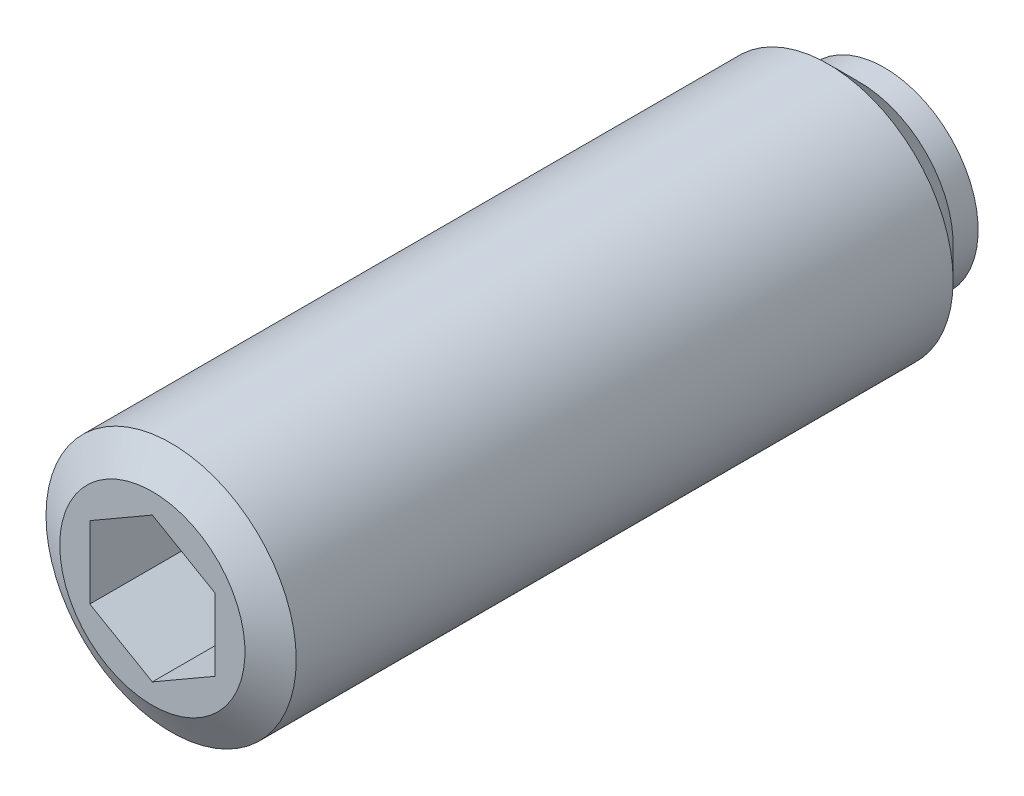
ISO-10303-21;
HEADER;
FILE_DESCRIPTION(('STEP AP214'),'2;1');
FILE_NAME('part.step','',(''),(''),'','','');
FILE_SCHEMA(('AUTOMOTIVE_DESIGN { 1 0 10303 214 1 1 1 1 }'));
ENDSEC;
DATA;
#1=APPLICATION_CONTEXT('core data for automotive mechanical design processes');
#2=APPLICATION_PROTOCOL_DEFINITION('international standard','automotive_design',2000,#1);
#3=PRODUCT_CONTEXT('',#1,'mechanical');
#4=PRODUCT('Part','Part','',(#3));
#5=PRODUCT_RELATED_PRODUCT_CATEGORY('part','',(#4));
#6=PRODUCT_DEFINITION_FORMATION('','',#4);
#7=PRODUCT_DEFINITION_CONTEXT('part definition',#1,'design');
#8=PRODUCT_DEFINITION('design','',#6,#7);
#9=PRODUCT_DEFINITION_SHAPE('','',#8);
#10=(LENGTH_UNIT() NAMED_UNIT(*) SI_UNIT(.MILLI.,.METRE.));
#11=(NAMED_UNIT(*) PLANE_ANGLE_UNIT() SI_UNIT($,.RADIAN.));
#12=(NAMED_UNIT(*) SI_UNIT($,.STERADIAN.) SOLID_ANGLE_UNIT());
#13=UNCERTAINTY_MEASURE_WITH_UNIT(LENGTH_MEASURE(1.E-05),#10,'distance_accuracy_value','');
#14=(GEOMETRIC_REPRESENTATION_CONTEXT(3) GLOBAL_UNCERTAINTY_ASSIGNED_CONTEXT((#13)) GLOBAL_UNIT_ASSIGNED_CONTEXT((#10,
#11,#12)) REPRESENTATION_CONTEXT('',''));
#15=CARTESIAN_POINT('',(0.,0.,0.));
#16=DIRECTION('',(0.,0.,1.));
#17=DIRECTION('',(1.,0.,0.));
#18=AXIS2_PLACEMENT_3D('',#15,#16,#17);
#19=CARTESIAN_POINT('',(0.,0.940733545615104,0.));
#20=DIRECTION('',(0.,0.,1.));
#21=DIRECTION('',(-1.,0.,0.));
#22=AXIS2_PLACEMENT_3D('',#19,#20,#21);
#23=PLANE('',#22);
#24=CARTESIAN_POINT('',(0.,0.,0.));
#25=DIRECTION('',(0.,0.,1.));
#26=DIRECTION('',(-1.,0.,0.));
#27=AXIS2_PLACEMENT_3D('',#24,#25,#26);
#28=CIRCLE('',#27,0.940733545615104);
#29=CARTESIAN_POINT('',(0.,0.9407335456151,0.));
#30=VERTEX_POINT('',#29);
#31=EDGE_CURVE('E9',#30,#30,#28,.T.);
#32=ORIENTED_EDGE('',*,*,#31,.F.);
#33=EDGE_LOOP('',(#32));
#34=FACE_BOUND('',#33,.T.);
#35=ADVANCED_FACE('F14',(#34),#23,.F.);
#36=CARTESIAN_POINT('',(0.,0.,0.823116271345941));
#37=DIRECTION('',(0.,0.,1.));
#38=DIRECTION('',(0.,1.,0.));
#39=AXIS2_PLACEMENT_3D('',#36,#37,#38);
#40=SPHERICAL_SURFACE('',#39,1.25);
#41=CARTESIAN_POINT('',(0.,0.,0.2));
#42=DIRECTION('',(0.,0.,1.));
#43=DIRECTION('',(-1.,0.,0.));
#44=AXIS2_PLACEMENT_3D('',#41,#42,#43);
#45=CIRCLE('',#44,1.0836171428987);
#46=CARTESIAN_POINT('',(0.,1.0836171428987,0.2));
#47=VERTEX_POINT('',#46);
#48=EDGE_CURVE('E21',#47,#47,#45,.T.);
#49=CARTESIAN_POINT('',(0.,1.0836171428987,0.2));
#50=CARTESIAN_POINT('',(0.,1.08233874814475,0.197776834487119));
#51=CARTESIAN_POINT('',(0.,1.08105351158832,0.1955576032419));
#52=CARTESIAN_POINT('',(0.,1.0784694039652,0.191127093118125));
#53=CARTESIAN_POINT('',(0.,1.0771705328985,0.188915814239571));
#54=CARTESIAN_POINT('',(0.,1.07455920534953,0.184501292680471));
#55=CARTESIAN_POINT('',(0.,1.07324674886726,0.182298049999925));
#56=CARTESIAN_POINT('',(0.,1.07060830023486,0.177899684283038));
#57=CARTESIAN_POINT('',(0.,1.06928230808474,0.175704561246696));
#58=CARTESIAN_POINT('',(0.,1.06661683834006,0.171322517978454));
#59=CARTESIAN_POINT('',(0.,1.0652773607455,0.169135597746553));
#60=CARTESIAN_POINT('',(0.,1.06258497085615,0.164770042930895));
#61=CARTESIAN_POINT('',(0.,1.06123205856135,0.162591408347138));
#62=CARTESIAN_POINT('',(0.,1.05851285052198,0.158242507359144));
#63=CARTESIAN_POINT('',(0.,1.05714655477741,0.156072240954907));
#64=CARTESIAN_POINT('',(0.,1.05440063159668,0.151740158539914));
#65=CARTESIAN_POINT('',(0.,1.05302100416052,0.149578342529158));
#66=CARTESIAN_POINT('',(0.,1.05024846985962,0.145263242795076));
#67=CARTESIAN_POINT('',(0.,1.04885556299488,0.143109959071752));
#68=CARTESIAN_POINT('',(0.,1.04605652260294,0.138812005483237));
#69=CARTESIAN_POINT('',(0.,1.04465038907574,0.136667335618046));
#70=CARTESIAN_POINT('',(0.,1.04182494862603,0.132386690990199));
#71=CARTESIAN_POINT('',(0.,1.04040564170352,0.130250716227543));
#72=CARTESIAN_POINT('',(0.,1.0375539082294,0.125987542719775));
#73=CARTESIAN_POINT('',(0.,1.03612148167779,0.123860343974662));
#74=CARTESIAN_POINT('',(0.,1.03324356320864,0.119614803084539));
#75=CARTESIAN_POINT('',(0.,1.03179807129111,0.117496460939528));
#76=CARTESIAN_POINT('',(0.,1.02889407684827,0.113268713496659));
#77=CARTESIAN_POINT('',(0.,1.02743557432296,0.1111593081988));
#78=CARTESIAN_POINT('',(0.,1.02450561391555,0.106949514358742));
#79=CARTESIAN_POINT('',(0.,1.02303415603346,0.104849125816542));
#80=CARTESIAN_POINT('',(0.,1.02007834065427,0.100657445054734));
#81=CARTESIAN_POINT('',(0.,1.01859398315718,0.0985661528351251));
#82=CARTESIAN_POINT('',(0.,1.01561242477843,0.094392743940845));
#83=CARTESIAN_POINT('',(0.,1.01411522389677,0.0923106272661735));
#84=CARTESIAN_POINT('',(0.,1.01110803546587,0.0881556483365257));
#85=CARTESIAN_POINT('',(0.,1.00959804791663,0.0860827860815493));
#86=CARTESIAN_POINT('',(0.,1.00656534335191,0.0819463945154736));
#87=CARTESIAN_POINT('',(0.,1.00504262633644,0.0798828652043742));
#88=CARTESIAN_POINT('',(0.,1.00198452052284,0.0757652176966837));
#89=CARTESIAN_POINT('',(0.,1.00044913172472,0.0737110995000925));
#90=CARTESIAN_POINT('',(0.,0.997365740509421,0.0696123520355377));
#91=CARTESIAN_POINT('',(0.,0.995817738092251,0.0675677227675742));
#92=CARTESIAN_POINT('',(0.,0.992709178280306,0.0634880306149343));
#93=CARTESIAN_POINT('',(0.,0.99114862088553,0.061452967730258));
#94=CARTESIAN_POINT('',(0.,0.988015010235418,0.0573924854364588));
#95=CARTESIAN_POINT('',(0.,0.986441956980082,0.055367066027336));
#96=CARTESIAN_POINT('',(0.,0.983283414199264,0.0513259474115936));
#97=CARTESIAN_POINT('',(0.,0.981697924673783,0.049310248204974));
#98=CARTESIAN_POINT('',(0.,0.978514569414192,0.0452886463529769));
#99=CARTESIAN_POINT('',(0.,0.976916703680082,0.0432827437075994));
#100=CARTESIAN_POINT('',(0.,0.973708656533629,0.0392808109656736));
#101=CARTESIAN_POINT('',(0.,0.972098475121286,0.0372847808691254));
#102=CARTESIAN_POINT('',(0.,0.968865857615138,0.0333026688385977));
#103=CARTESIAN_POINT('',(0.,0.967243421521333,0.0313165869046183));
#104=CARTESIAN_POINT('',(0.,0.963986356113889,0.0273544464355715));
#105=CARTESIAN_POINT('',(0.,0.962351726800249,0.0253783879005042));
#106=CARTESIAN_POINT('',(0.,0.959070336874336,0.0214363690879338));
#107=CARTESIAN_POINT('',(0.,0.957423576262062,0.0194704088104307));
#108=CARTESIAN_POINT('',(0.,0.95411798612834,0.0155486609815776));
#109=CARTESIAN_POINT('',(0.,0.952459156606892,0.0135928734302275));
#110=CARTESIAN_POINT('',(0.,0.949129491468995,0.00969154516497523));
#111=CARTESIAN_POINT('',(0.,0.947458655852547,0.00774600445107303));
#112=CARTESIAN_POINT('',(0.,0.944105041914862,0.00386524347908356));
#113=CARTESIAN_POINT('',(0.,0.942422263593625,0.00193002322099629));
#114=CARTESIAN_POINT('',(0.,0.9407335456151,0.));
#115=B_SPLINE_CURVE_WITH_KNOTS('',3,(#49,#50,#51,#52,#53,#54,#55,#56,#57,#58,#59,#60,#61,#62,
#63,#64,#65,#66,#67,#68,#69,#70,#71,#72,#73,#74,#75,#76,#77,#78,#79,#80,#81,#82,#83,#84,#85,#86,
#87,#88,#89,#90,#91,#92,#93,#94,#95,#96,#97,#98,#99,#100,#101,#102,#103,#104,#105,#106,#107,
#108,#109,#110,#111,#112,#113,#114),.UNSPECIFIED.,.F.,.F.,(4,2,2,2,2,2,2,2,2,2,2,2,2,2,2,2,2,2,
2,2,2,2,2,2,2,2,2,2,2,2,2,2,4),(0.,0.00769354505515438,0.0153870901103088,0.0230806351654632,
0.0307741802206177,0.0384677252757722,0.0461612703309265,0.0538548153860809,0.0615483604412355,
0.0692419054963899,0.0769354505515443,0.0846289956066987,0.092322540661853,0.100016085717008,
0.107709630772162,0.115403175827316,0.123096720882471,0.130790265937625,0.13848381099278,
0.146177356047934,0.153870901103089,0.161564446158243,0.169257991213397,0.176951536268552,
0.184645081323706,0.192338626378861,0.200032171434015,0.20772571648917,0.215419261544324,
0.223112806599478,0.230806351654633,0.238499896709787,0.246193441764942),.UNSPECIFIED.);
#116=EDGE_CURVE('BSEAM141',#47,#30,#115,.T.);
#117=ORIENTED_EDGE('',*,*,#48,.F.);
#118=ORIENTED_EDGE('',*,*,#31,.T.);
#119=ORIENTED_EDGE('',*,*,#116,.T.);
#120=ORIENTED_EDGE('',*,*,#116,.F.);
#121=EDGE_LOOP('',(#117,#119,#118,#120));
#122=FACE_BOUND('',#121,.T.);
#123=ADVANCED_FACE('F141',(#122),#40,.T.);
#124=CARTESIAN_POINT('',(0.,1.5,0.2));
#125=DIRECTION('',(0.,0.,1.));
#126=DIRECTION('',(-1.,0.,0.));
#127=AXIS2_PLACEMENT_3D('',#124,#125,#126);
#128=PLANE('',#127);
#129=CARTESIAN_POINT('',(0.,0.,0.2));
#130=DIRECTION('',(0.,0.,1.));
#131=DIRECTION('',(-1.,0.,0.));
#132=AXIS2_PLACEMENT_3D('',#129,#130,#131);
#133=CIRCLE('',#132,1.5);
#134=CARTESIAN_POINT('',(-1.5,0.,0.2));
#135=VERTEX_POINT('',#134);
#136=EDGE_CURVE('E134',#135,#135,#133,.T.);
#137=ORIENTED_EDGE('',*,*,#136,.F.);
#138=EDGE_LOOP('',(#137));
#139=FACE_BOUND('',#138,.T.);
#140=ORIENTED_EDGE('',*,*,#48,.T.);
#141=EDGE_LOOP('',(#140));
#142=FACE_BOUND('',#141,.T.);
#143=ADVANCED_FACE('F139',(#139,#142),#128,.F.);
#144=CARTESIAN_POINT('',(0.,0.,13.2950749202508));
#145=DIRECTION('',(0.,0.,1.));
#146=DIRECTION('',(-1.,0.,0.));
#147=AXIS2_PLACEMENT_3D('',#144,#145,#146);
#148=CYLINDRICAL_SURFACE('',#147,1.5);
#149=CARTESIAN_POINT('',(0.,0.,0.6));
#150=DIRECTION('',(0.,0.,1.));
#151=DIRECTION('',(-1.,0.,0.));
#152=AXIS2_PLACEMENT_3D('',#149,#150,#151);
#153=CIRCLE('',#152,1.5);
#154=CARTESIAN_POINT('',(-1.5,0.,0.6));
#155=VERTEX_POINT('',#154);
#156=EDGE_CURVE('E131',#155,#155,#153,.T.);
#157=ORIENTED_EDGE('',*,*,#156,.F.);
#158=EDGE_LOOP('',(#157));
#159=FACE_BOUND('',#158,.T.);
#160=ORIENTED_EDGE('',*,*,#136,.T.);
#161=EDGE_LOOP('',(#160));
#162=FACE_BOUND('',#161,.T.);
#163=ADVANCED_FACE('F164',(#159,#162),#148,.T.);
#164=CARTESIAN_POINT('',(0.,0.,0.6));
#165=DIRECTION('',(0.,0.,1.));
#166=DIRECTION('',(-1.,0.,0.));
#167=AXIS2_PLACEMENT_3D('',#164,#165,#166);
#168=CONICAL_SURFACE('',#167,1.5,0.78539816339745);
#169=CARTESIAN_POINT('',(0.,0.,1.1));
#170=DIRECTION('',(0.,0.,1.));
#171=DIRECTION('',(-1.,0.,0.));
#172=AXIS2_PLACEMENT_3D('',#169,#170,#171);
#173=CIRCLE('',#172,2.);
#174=CARTESIAN_POINT('',(-2.,0.,1.1));
#175=VERTEX_POINT('',#174);
#176=EDGE_CURVE('E128',#175,#175,#173,.T.);
#177=ORIENTED_EDGE('',*,*,#176,.F.);
#178=EDGE_LOOP('',(#177));
#179=FACE_BOUND('',#178,.T.);
#180=ORIENTED_EDGE('',*,*,#156,.T.);
#181=EDGE_LOOP('',(#180));
#182=FACE_BOUND('',#181,.T.);
#183=ADVANCED_FACE('F173',(#179,#182),#168,.T.);
#184=CARTESIAN_POINT('',(0.,0.,13.2950749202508));
#185=DIRECTION('',(0.,0.,1.));
#186=DIRECTION('',(-1.,0.,0.));
#187=AXIS2_PLACEMENT_3D('',#184,#185,#186);
#188=CYLINDRICAL_SURFACE('',#187,2.);
#189=CARTESIAN_POINT('',(0.,0.,11.6));
#190=DIRECTION('',(0.,0.,1.));
#191=DIRECTION('',(-1.,0.,0.));
#192=AXIS2_PLACEMENT_3D('',#189,#190,#191);
#193=CIRCLE('',#192,2.);
#194=CARTESIAN_POINT('',(-2.,0.,11.6));
#195=VERTEX_POINT('',#194);
#196=EDGE_CURVE('E125',#195,#195,#193,.T.);
#197=ORIENTED_EDGE('',*,*,#196,.F.);
#198=EDGE_LOOP('',(#197));
#199=FACE_BOUND('',#198,.T.);
#200=ORIENTED_EDGE('',*,*,#176,.T.);
#201=EDGE_LOOP('',(#200));
#202=FACE_BOUND('',#201,.T.);
#203=ADVANCED_FACE('F182',(#199,#202),#188,.T.);
#204=CARTESIAN_POINT('',(0.,0.,11.6));
#205=DIRECTION('',(0.,0.,-1.));
#206=DIRECTION('',(1.,0.,0.));
#207=AXIS2_PLACEMENT_3D('',#204,#205,#206);
#208=CONICAL_SURFACE('',#207,2.,1.04719755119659);
#209=CARTESIAN_POINT('',(0.,0.,11.9));
#210=DIRECTION('',(0.,0.,1.));
#211=DIRECTION('',(-1.,0.,0.));
#212=AXIS2_PLACEMENT_3D('',#209,#210,#211);
#213=CIRCLE('',#212,1.48038475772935);
#214=CARTESIAN_POINT('',(-1.48038475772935,0.,11.9));
#215=VERTEX_POINT('',#214);
#216=EDGE_CURVE('E116',#215,#215,#213,.T.);
#217=ORIENTED_EDGE('',*,*,#216,.F.);
#218=EDGE_LOOP('',(#217));
#219=FACE_BOUND('',#218,.T.);
#220=ORIENTED_EDGE('',*,*,#196,.T.);
#221=EDGE_LOOP('',(#220));
#222=FACE_BOUND('',#221,.T.);
#223=ADVANCED_FACE('F191',(#219,#222),#208,.T.);
#224=CARTESIAN_POINT('',(0.,0.,11.9));
#225=DIRECTION('',(0.,0.,-1.));
#226=DIRECTION('',(1.,0.,0.));
#227=AXIS2_PLACEMENT_3D('',#224,#225,#226);
#228=PLANE('',#227);
#229=DIRECTION('',(-0.866025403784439,-0.5,0.));
#230=VECTOR('',#229,1.);
#231=CARTESIAN_POINT('',(0.,1.15470053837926,11.9));
#232=LINE('',#231,#230);
#233=CARTESIAN_POINT('',(0.,1.15470053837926,11.9));
#234=VERTEX_POINT('',#233);
#235=CARTESIAN_POINT('',(-1.,0.577350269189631,11.9));
#236=VERTEX_POINT('',#235);
#237=EDGE_CURVE('E82',#234,#236,#232,.T.);
#238=ORIENTED_EDGE('',*,*,#237,.F.);
#239=DIRECTION('',(-0.866025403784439,0.5,0.));
#240=VECTOR('',#239,1.);
#241=CARTESIAN_POINT('',(1.,0.577350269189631,11.9));
#242=LINE('',#241,#240);
#243=CARTESIAN_POINT('',(1.,0.577350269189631,11.9));
#244=VERTEX_POINT('',#243);
#245=EDGE_CURVE('E28',#244,#234,#242,.T.);
#246=ORIENTED_EDGE('',*,*,#245,.F.);
#247=DIRECTION('',(0.,1.,0.));
#248=VECTOR('',#247,1.);
#249=CARTESIAN_POINT('',(1.,-0.577350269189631,11.9));
#250=LINE('',#249,#248);
#251=CARTESIAN_POINT('',(1.,-0.577350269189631,11.9));
#252=VERTEX_POINT('',#251);
#253=EDGE_CURVE('E98',#252,#244,#250,.T.);
#254=ORIENTED_EDGE('',*,*,#253,.F.);
#255=DIRECTION('',(0.866025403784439,0.5,0.));
#256=VECTOR('',#255,1.);
#257=CARTESIAN_POINT('',(0.,-1.15470053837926,11.9));
#258=LINE('',#257,#256);
#259=CARTESIAN_POINT('',(0.,-1.15470053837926,11.9));
#260=VERTEX_POINT('',#259);
#261=EDGE_CURVE('E92',#260,#252,#258,.T.);
#262=ORIENTED_EDGE('',*,*,#261,.F.);
#263=DIRECTION('',(0.866025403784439,-0.5,0.));
#264=VECTOR('',#263,1.);
#265=CARTESIAN_POINT('',(-1.,-0.577350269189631,11.9));
#266=LINE('',#265,#264);
#267=CARTESIAN_POINT('',(-1.,-0.577350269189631,11.9));
#268=VERTEX_POINT('',#267);
#269=EDGE_CURVE('E90',#268,#260,#266,.T.);
#270=ORIENTED_EDGE('',*,*,#269,.F.);
#271=DIRECTION('',(0.,-1.,0.));
#272=VECTOR('',#271,1.);
#273=CARTESIAN_POINT('',(-1.,0.577350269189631,11.9));
#274=LINE('',#273,#272);
#275=EDGE_CURVE('E71',#236,#268,#274,.T.);
#276=ORIENTED_EDGE('',*,*,#275,.F.);
#277=EDGE_LOOP('',(#238,#246,#254,#262,#270,#276));
#278=FACE_BOUND('',#277,.T.);
#279=ORIENTED_EDGE('',*,*,#216,.T.);
#280=EDGE_LOOP('',(#279));
#281=FACE_BOUND('',#280,.T.);
#282=ADVANCED_FACE('F86',(#278,#281),#228,.F.);
#283=CARTESIAN_POINT('',(1.,0.577350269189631,9.9));
#284=DIRECTION('',(0.5,0.866025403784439,0.));
#285=DIRECTION('',(0.866025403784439,-0.5,0.));
#286=AXIS2_PLACEMENT_3D('',#283,#284,#285);
#287=PLANE('',#286);
#288=ORIENTED_EDGE('',*,*,#245,.T.);
#289=DIRECTION('',(0.,0.,1.));
#290=VECTOR('',#289,1.);
#291=CARTESIAN_POINT('',(0.,1.15470053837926,9.9));
#292=LINE('',#291,#290);
#293=CARTESIAN_POINT('',(0.,1.15470053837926,9.9));
#294=VERTEX_POINT('',#293);
#295=EDGE_CURVE('E79',#294,#234,#292,.T.);
#296=ORIENTED_EDGE('',*,*,#295,.F.);
#297=DIRECTION('',(-0.866025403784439,0.5,0.));
#298=VECTOR('',#297,1.);
#299=CARTESIAN_POINT('',(1.,0.577350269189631,9.9));
#300=LINE('',#299,#298);
#301=CARTESIAN_POINT('',(1.,0.577350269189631,9.9));
#302=VERTEX_POINT('',#301);
#303=EDGE_CURVE('E100',#302,#294,#300,.T.);
#304=ORIENTED_EDGE('',*,*,#303,.F.);
#305=DIRECTION('',(0.,0.,1.));
#306=VECTOR('',#305,1.);
#307=CARTESIAN_POINT('',(1.,0.577350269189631,9.9));
#308=LINE('',#307,#306);
#309=EDGE_CURVE('E35',#302,#244,#308,.T.);
#310=ORIENTED_EDGE('',*,*,#309,.T.);
#311=EDGE_LOOP('',(#288,#296,#304,#310));
#312=FACE_BOUND('',#311,.T.);
#313=ADVANCED_FACE('F208',(#312),#287,.F.);
#314=CARTESIAN_POINT('',(1.,-0.577350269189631,9.9));
#315=DIRECTION('',(1.,0.,0.));
#316=DIRECTION('',(0.,-1.,0.));
#317=AXIS2_PLACEMENT_3D('',#314,#315,#316);
#318=PLANE('',#317);
#319=ORIENTED_EDGE('',*,*,#253,.T.);
#320=ORIENTED_EDGE('',*,*,#309,.F.);
#321=DIRECTION('',(0.,1.,0.));
#322=VECTOR('',#321,1.);
#323=CARTESIAN_POINT('',(1.,-0.577350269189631,9.9));
#324=LINE('',#323,#322);
#325=CARTESIAN_POINT('',(1.,-0.577350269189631,9.9));
#326=VERTEX_POINT('',#325);
#327=EDGE_CURVE('E112',#326,#302,#324,.T.);
#328=ORIENTED_EDGE('',*,*,#327,.F.);
#329=DIRECTION('',(0.,0.,1.));
#330=VECTOR('',#329,1.);
#331=CARTESIAN_POINT('',(1.,-0.577350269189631,9.9));
#332=LINE('',#331,#330);
#333=EDGE_CURVE('E117',#326,#252,#332,.T.);
#334=ORIENTED_EDGE('',*,*,#333,.T.);
#335=EDGE_LOOP('',(#319,#320,#328,#334));
#336=FACE_BOUND('',#335,.T.);
#337=ADVANCED_FACE('F216',(#336),#318,.F.);
#338=CARTESIAN_POINT('',(0.,-1.15470053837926,9.9));
#339=DIRECTION('',(0.5,-0.866025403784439,0.));
#340=DIRECTION('',(-0.866025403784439,-0.5,0.));
#341=AXIS2_PLACEMENT_3D('',#338,#339,#340);
#342=PLANE('',#341);
#343=ORIENTED_EDGE('',*,*,#261,.T.);
#344=ORIENTED_EDGE('',*,*,#333,.F.);
#345=DIRECTION('',(0.866025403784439,0.5,0.));
#346=VECTOR('',#345,1.);
#347=CARTESIAN_POINT('',(0.,-1.15470053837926,9.9));
#348=LINE('',#347,#346);
#349=CARTESIAN_POINT('',(0.,-1.15470053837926,9.9));
#350=VERTEX_POINT('',#349);
#351=EDGE_CURVE('E109',#350,#326,#348,.T.);
#352=ORIENTED_EDGE('',*,*,#351,.F.);
#353=DIRECTION('',(0.,0.,1.));
#354=VECTOR('',#353,1.);
#355=CARTESIAN_POINT('',(0.,-1.15470053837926,9.9));
#356=LINE('',#355,#354);
#357=EDGE_CURVE('E119',#350,#260,#356,.T.);
#358=ORIENTED_EDGE('',*,*,#357,.T.);
#359=EDGE_LOOP('',(#343,#344,#352,#358));
#360=FACE_BOUND('',#359,.T.);
#361=ADVANCED_FACE('F224',(#360),#342,.F.);
#362=CARTESIAN_POINT('',(-1.,-0.577350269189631,9.9));
#363=DIRECTION('',(-0.5,-0.866025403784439,0.));
#364=DIRECTION('',(-0.866025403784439,0.5,0.));
#365=AXIS2_PLACEMENT_3D('',#362,#363,#364);
#366=PLANE('',#365);
#367=ORIENTED_EDGE('',*,*,#269,.T.);
#368=ORIENTED_EDGE('',*,*,#357,.F.);
#369=DIRECTION('',(0.866025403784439,-0.5,0.));
#370=VECTOR('',#369,1.);
#371=CARTESIAN_POINT('',(-1.,-0.577350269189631,9.9));
#372=LINE('',#371,#370);
#373=CARTESIAN_POINT('',(-1.,-0.577350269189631,9.9));
#374=VERTEX_POINT('',#373);
#375=EDGE_CURVE('E106',#374,#350,#372,.T.);
#376=ORIENTED_EDGE('',*,*,#375,.F.);
#377=DIRECTION('',(0.,0.,1.));
#378=VECTOR('',#377,1.);
#379=CARTESIAN_POINT('',(-1.,-0.577350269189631,9.9));
#380=LINE('',#379,#378);
#381=EDGE_CURVE('E78',#374,#268,#380,.T.);
#382=ORIENTED_EDGE('',*,*,#381,.T.);
#383=EDGE_LOOP('',(#367,#368,#376,#382));
#384=FACE_BOUND('',#383,.T.);
#385=ADVANCED_FACE('F232',(#384),#366,.F.);
#386=CARTESIAN_POINT('',(-1.,0.577350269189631,9.9));
#387=DIRECTION('',(-1.,0.,0.));
#388=DIRECTION('',(0.,0.,-1.));
#389=AXIS2_PLACEMENT_3D('',#386,#387,#388);
#390=PLANE('',#389);
#391=ORIENTED_EDGE('',*,*,#275,.T.);
#392=ORIENTED_EDGE('',*,*,#381,.F.);
#393=DIRECTION('',(0.,-1.,0.));
#394=VECTOR('',#393,1.);
#395=CARTESIAN_POINT('',(-1.,0.577350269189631,9.9));
#396=LINE('',#395,#394);
#397=CARTESIAN_POINT('',(-1.,0.577350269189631,9.9));
#398=VERTEX_POINT('',#397);
#399=EDGE_CURVE('E74',#398,#374,#396,.T.);
#400=ORIENTED_EDGE('',*,*,#399,.F.);
#401=DIRECTION('',(0.,0.,1.));
#402=VECTOR('',#401,1.);
#403=CARTESIAN_POINT('',(-1.,0.577350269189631,9.9));
#404=LINE('',#403,#402);
#405=EDGE_CURVE('E67',#398,#236,#404,.T.);
#406=ORIENTED_EDGE('',*,*,#405,.T.);
#407=EDGE_LOOP('',(#391,#392,#400,#406));
#408=FACE_BOUND('',#407,.T.);
#409=ADVANCED_FACE('F69',(#408),#390,.F.);
#410=CARTESIAN_POINT('',(0.,1.15470053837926,9.9));
#411=DIRECTION('',(-0.5,0.866025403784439,0.));
#412=DIRECTION('',(0.866025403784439,0.5,0.));
#413=AXIS2_PLACEMENT_3D('',#410,#411,#412);
#414=PLANE('',#413);
#415=ORIENTED_EDGE('',*,*,#237,.T.);
#416=ORIENTED_EDGE('',*,*,#405,.F.);
#417=DIRECTION('',(-0.866025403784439,-0.5,0.));
#418=VECTOR('',#417,1.);
#419=CARTESIAN_POINT('',(0.,1.15470053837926,9.9));
#420=LINE('',#419,#418);
#421=EDGE_CURVE('E103',#294,#398,#420,.T.);
#422=ORIENTED_EDGE('',*,*,#421,.F.);
#423=ORIENTED_EDGE('',*,*,#295,.T.);
#424=EDGE_LOOP('',(#415,#416,#422,#423));
#425=FACE_BOUND('',#424,.T.);
#426=ADVANCED_FACE('F83',(#425),#414,.F.);
#427=CARTESIAN_POINT('',(2.,0.,9.9));
#428=DIRECTION('',(0.,0.,-1.));
#429=DIRECTION('',(1.,0.,0.));
#430=AXIS2_PLACEMENT_3D('',#427,#428,#429);
#431=PLANE('',#430);
#432=ORIENTED_EDGE('',*,*,#303,.T.);
#433=ORIENTED_EDGE('',*,*,#421,.T.);
#434=ORIENTED_EDGE('',*,*,#399,.T.);
#435=ORIENTED_EDGE('',*,*,#375,.T.);
#436=ORIENTED_EDGE('',*,*,#351,.T.);
#437=ORIENTED_EDGE('',*,*,#327,.T.);
#438=EDGE_LOOP('',(#432,#433,#434,#435,#436,#437));
#439=FACE_BOUND('',#438,.T.);
#440=ADVANCED_FACE('F256',(#439),#431,.F.);
#441=CLOSED_SHELL('',(#35,#123,#143,#163,#183,#203,#223,#282,#313,#337,#361,#385,#409,#426,#440));
#442=MANIFOLD_SOLID_BREP('B1',#441);
#443=ADVANCED_BREP_SHAPE_REPRESENTATION('',(#18,#442),#14);
#444=SHAPE_DEFINITION_REPRESENTATION(#9,#443);
ENDSEC;
END-ISO-10303-21;
